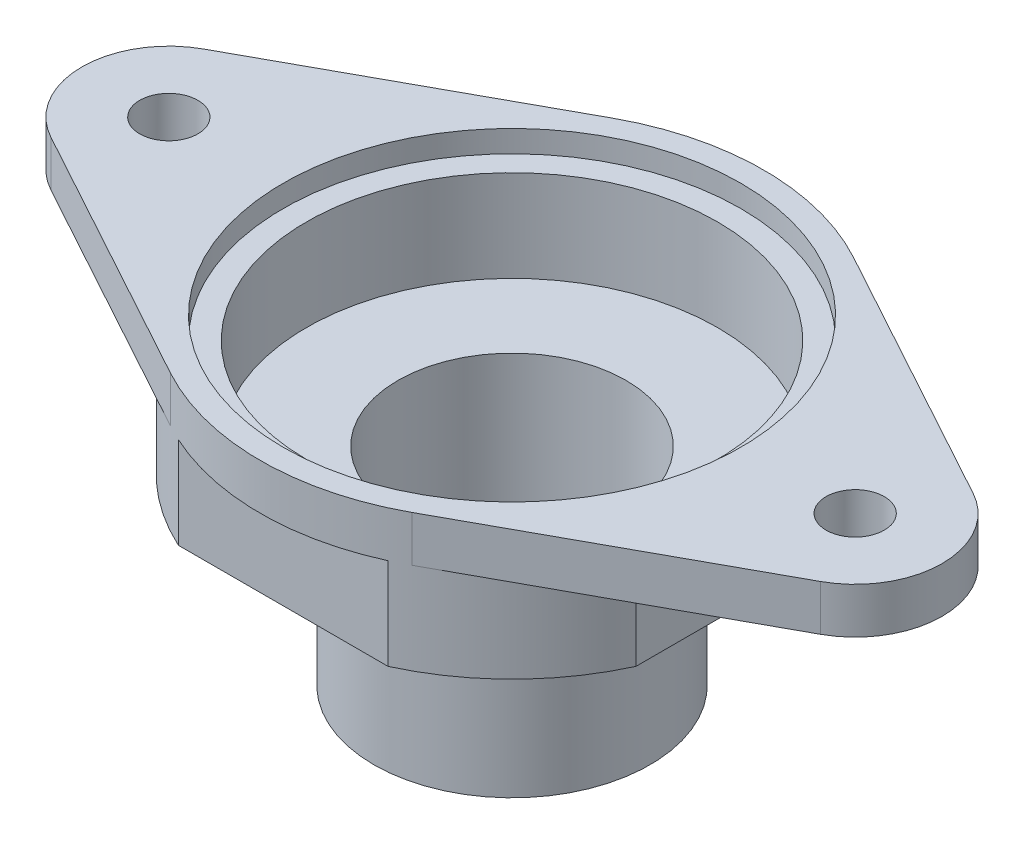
from build123d import *
from build123d.topology import SkipClean

# Parameters (mm, degrees)
SKETCH1_W              = 63.5
SKETCH1_H              = 50.8
BOSS_EXTRUDE1_DEPTH    = 22.225
SKETCH2_R              = 14.26845
CUT_EXTRUDE1_DEPTH     = 7.874
SKETCH5_R              = 15.875
CUT_EXTRUDE3_DEPTH     = 1.524
F_10_32_TAPPED_HOLE1_D = 4.0386
SKETCH10_OUTSIDE_W     = 82.36
SKETCH10_OUTSIDE_H     = 69.66
CUT_EXTRUDE5_DEPTH     = 25.4
SKETCH11_OUTSIDE_W     = 76.218
SKETCH11_OUTSIDE_H     = 51.452
SKETCH11_OUTSIDE_W_2   = 31.75
SKETCH11_OUTSIDE_H_2   = 31.75
CUT_EXTRUDE7_DEPTH     = 19.05
SKETCH12_R             = 7.91845
CUT_EXTRUDE8_DEPTH     = 77.400845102
SKETCH13_OUTSIDE_W     = 76.218
SKETCH13_OUTSIDE_H     = 51.452
SKETCH13_OUTSIDE_R     = 9.58215
CUT_EXTRUDE9_DEPTH     = 12.7
SKETCH14_OUTSIDE_W     = 76.218
SKETCH14_OUTSIDE_H     = 51.452
SKETCH14_OUTSIDE_R     = 17.4625
CUT_EXTRUDE10_DEPTH    = 6.35


with BuildPart() as part:
    # Sketch1 → Boss-Extrude1 (new body)
    with BuildSketch(Plane(origin=(0, 0, 0), x_dir=(1, 0, 0), z_dir=(0, 1, 0))):
        with Locations((31.75, 25.4)):
            Rectangle(SKETCH1_W, SKETCH1_H)
    extrude(amount=BOSS_EXTRUDE1_DEPTH)

    # Sketch2 → Cut-Extrude1 (cut)
    with BuildSketch(Plane(origin=(0, 22.225, 0), x_dir=(1, 0, 0), z_dir=(0, 1, 0))):
        with Locations(Location((31.75, 25.4, 0), (0, 0, 270))):
            Circle(SKETCH2_R)
    extrude(amount=-CUT_EXTRUDE1_DEPTH, mode=Mode.SUBTRACT)

    # Sketch5 → Cut-Extrude3 (cut)
    with BuildSketch(Plane(origin=(0, 22.225, 0), x_dir=(1, 0, 0), z_dir=(0, 1, 0))):
        with Locations(Location((31.75, 25.4, 0), (0, 0, 270))):
            Circle(SKETCH5_R)
    extrude(amount=-CUT_EXTRUDE3_DEPTH, mode=Mode.SUBTRACT)

    # 10-32 Tapped Hole1 (through all)
    with Locations(Plane(origin=(0, 22.225, 0), x_dir=(1, 0, 0), z_dir=(0, 1, 0))):
        with Locations((7.9375, 25.4), (55.5625, 25.4)):
            Hole(F_10_32_TAPPED_HOLE1_D / 2)

    # Sketch10 outside → Cut-Extrude5 (cut)
    with BuildSketch(Plane(origin=(0, 22.225, 0), x_dir=(1, 0, 0), z_dir=(0, 1, 0))):
        with Locations((31.75, 25.4)):
            Rectangle(SKETCH10_OUTSIDE_W, SKETCH10_OUTSIDE_H)
        with BuildLine():
            Line((5.0419, 30.692122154), (23.368, 40.719300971))
            ThreePointArc((23.368, 40.719300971), (31.75, 42.8625), (40.132, 40.719300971))
            Line((40.132, 40.719300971), (58.4581, 30.692122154))
            ThreePointArc((58.4581, 30.692122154), (61.595, 25.4), (58.4581, 20.107877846))
            Line((58.4581, 20.107877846), (40.132, 10.080699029))
            ThreePointArc((40.132, 10.080699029), (31.75, 7.9375), (23.368, 10.080699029))
            Line((23.368, 10.080699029), (5.0419, 20.107877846))
            ThreePointArc((5.0419, 20.107877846), (1.905, 25.4), (5.0419, 30.692122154))
        make_face(mode=Mode.SUBTRACT)
    extrude(amount=-CUT_EXTRUDE5_DEPTH, mode=Mode.SUBTRACT)

    # Sketch11 outside → Cut-Extrude7 (cut)
    with BuildSketch(Plane(origin=(0, 0, 0), x_dir=(-1, 0, 0), z_dir=(0, -1, 0))):
        with Locations((-31.75, 25.4)):
            Rectangle(SKETCH11_OUTSIDE_W, SKETCH11_OUTSIDE_H)
        with Locations((-31.75, 25.4)):
            Rectangle(SKETCH11_OUTSIDE_W_2, SKETCH11_OUTSIDE_H_2, mode=Mode.SUBTRACT)
    extrude(amount=-CUT_EXTRUDE7_DEPTH, mode=Mode.SUBTRACT)

    # Sketch12 → Cut-Extrude8 (cut, through all)
    with BuildSketch(Plane(origin=(0, 14.351, 0), x_dir=(1, 0, 0), z_dir=(0, 1, 0))):
        with Locations(Location((31.75, 25.4, 0), (0, 0, 270))):
            Circle(SKETCH12_R)
    extrude(amount=-CUT_EXTRUDE8_DEPTH, mode=Mode.SUBTRACT)

    # Sketch13 outside → Cut-Extrude9 (cut)
    with BuildSketch(Plane(origin=(0, 0, 0), x_dir=(-1, 0, 0), z_dir=(0, -1, 0))):
        with Locations((-31.75, 25.4)):
            Rectangle(SKETCH13_OUTSIDE_W, SKETCH13_OUTSIDE_H)
        with Locations(Location((-31.75, 25.4, 0), (0, 0, 90))):
            Circle(SKETCH13_OUTSIDE_R, mode=Mode.SUBTRACT)
    extrude(amount=-CUT_EXTRUDE9_DEPTH, mode=Mode.SUBTRACT)

    # Sketch14 outside → Cut-Extrude10 (cut)
    with SkipClean():  # the faces are left unmerged after this step: merging them gives an invalid solid
        with BuildSketch(Plane(origin=(0, 12.7, 0), x_dir=(-1, 0, 0), z_dir=(0, -1, 0))):
            with Locations((-31.75, 25.4)):
                Rectangle(SKETCH14_OUTSIDE_W, SKETCH14_OUTSIDE_H)
            with Locations((-31.75, 25.4)):
                Circle(SKETCH14_OUTSIDE_R, mode=Mode.SUBTRACT)
        extrude(amount=-CUT_EXTRUDE10_DEPTH, mode=Mode.SUBTRACT)


solid = part.part
